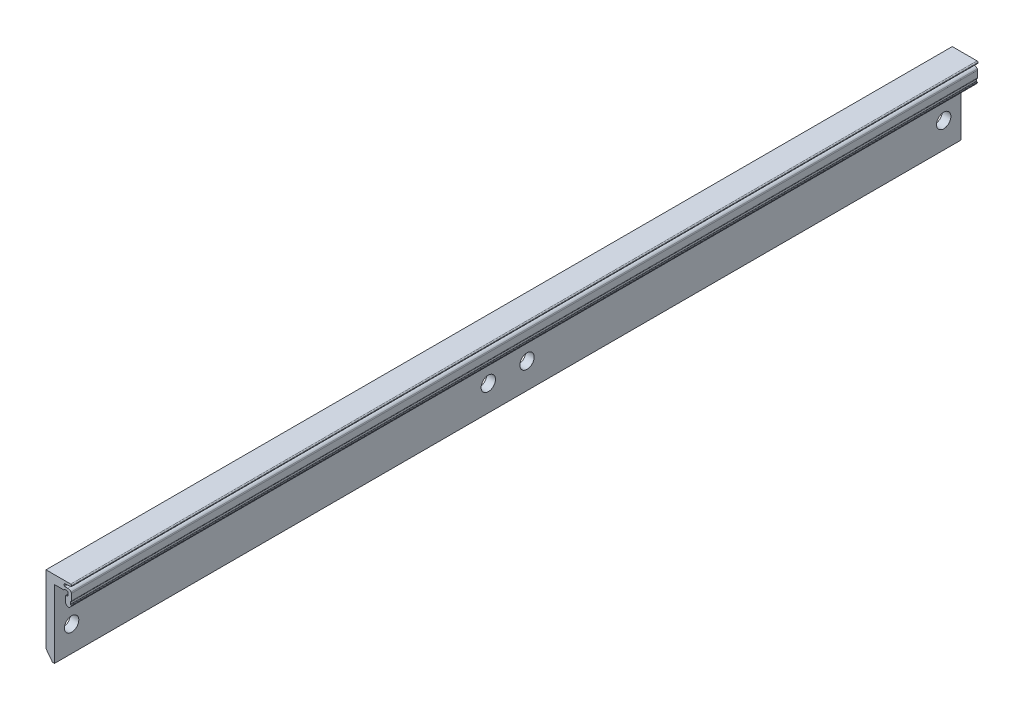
from build123d import *

# Parameters (mm, degrees)
EXTRUDE_1_DEPTH     = 132.675
SKETCH_3_R          = 2.1
CUT_EXTRUDE_2_DEPTH = 3316.268200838


with BuildPart() as part:
    # Sketch 1 → Extrude 1 (new, symmetric)
    with BuildSketch(Plane.XY):
        with BuildLine():
            Line((2350.384035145, -3290.103769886), (2355.384035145, -3290.103769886))
            Line((2355.384035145, -3290.103769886), (2357.624035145, -3290.103769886))
            ThreePointArc((2357.624035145, -3290.103769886), (2357.836167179, -3290.191637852), (2357.924035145, -3290.403769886))
            Line((2357.924035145, -3290.403769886), (2357.924035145, -3290.492459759))
            ThreePointArc((2357.924035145, -3290.492459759), (2357.87266411, -3290.626285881), (2357.744940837, -3290.691364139))
            Line((2357.744940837, -3290.691364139), (2355.903129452, -3290.884946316))
            ThreePointArc((2355.903129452, -3290.884946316), (2355.775406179, -3290.950024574), (2355.724035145, -3291.083850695))
            Line((2355.724035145, -3291.083850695), (2355.724035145, -3291.403769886))
            ThreePointArc((2355.724035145, -3291.403769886), (2355.782613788, -3291.545191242), (2355.924035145, -3291.603769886))
            Line((2355.924035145, -3291.603769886), (2356.769984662, -3291.603769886))
            ThreePointArc((2356.769984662, -3291.603769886), (2357.299096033, -3291.726717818), (2357.719785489, -3292.070367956))
            ThreePointArc((2357.719785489, -3292.070367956), (2357.797255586, -3292.214513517), (2357.824035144, -3292.375952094))
            Line((2357.824035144, -3292.375952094), (2357.824035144, -3294.273769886))
            ThreePointArc((2357.824035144, -3294.273769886), (2357.779946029, -3294.430325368), (2357.660637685, -3294.540864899))
            ThreePointArc((2357.660637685, -3294.540864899), (2357.54132934, -3294.65140443), (2357.497240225, -3294.807959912))
            Line((2357.497240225, -3294.807959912), (2357.497240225, -3295.307959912))
            ThreePointArc((2357.497240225, -3295.307959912), (2357.526529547, -3295.37867059), (2357.597240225, -3295.407959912))
            Line((2357.597240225, -3295.407959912), (2357.724035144, -3295.407959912))
            ThreePointArc((2357.724035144, -3295.407959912), (2357.794745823, -3295.437249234), (2357.824035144, -3295.507959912))
            Line((2357.824035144, -3295.507959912), (2357.824035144, -3295.527361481))
            ThreePointArc((2357.824035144, -3295.527361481), (2357.818000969, -3295.561572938), (2357.800626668, -3295.591655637))
            Line((2357.800626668, -3295.591655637), (2357.383057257, -3296.089092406))
            ThreePointArc((2357.383057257, -3296.089092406), (2356.924035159, -3296.303081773), (2356.465013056, -3296.089092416))
            Line((2356.465013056, -3296.089092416), (2356.094260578, -3295.647427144))
            ThreePointArc((2356.094260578, -3295.647427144), (2356.042137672, -3295.557179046), (2356.024035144, -3295.454544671))
            Line((2356.024035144, -3295.454544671), (2356.024035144, -3294.003769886))
            ThreePointArc((2356.024035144, -3294.003769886), (2356.11190311, -3293.791637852), (2356.324035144, -3293.703769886))
            Line((2356.324035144, -3293.703769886), (2356.524035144, -3293.703769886))
            ThreePointArc((2356.524035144, -3293.703769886), (2356.736167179, -3293.61590192), (2356.824035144, -3293.403769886))
            Line((2356.824035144, -3293.403769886), (2356.824035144, -3292.603769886))
            ThreePointArc((2356.824035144, -3292.603769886), (2356.736167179, -3292.391637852), (2356.524035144, -3292.303769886))
            Line((2356.524035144, -3292.303769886), (2355.987964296, -3292.303769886))
            ThreePointArc((2355.987964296, -3292.303769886), (2355.837964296, -3292.343962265), (2355.728156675, -3292.453769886))
            ThreePointArc((2355.728156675, -3292.453769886), (2355.618349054, -3292.563577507), (2355.468349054, -3292.603769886))
            Line((2355.468349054, -3292.603769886), (2355.384035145, -3292.603769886))
            Line((2355.384035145, -3292.603769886), (2352.884035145, -3292.603769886))
            Line((2352.884035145, -3292.603769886), (2352.884035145, -3312.603769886))
            Line((2352.884035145, -3312.603769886), (2352.284035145, -3312.603769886))
            Line((2352.284035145, -3312.603769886), (2350.384035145, -3310.103769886))
            Line((2350.384035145, -3310.103769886), (2350.384035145, -3292.603769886))
            Line((2350.384035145, -3292.603769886), (2350.384035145, -3290.103769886))
        make_face()
    extrude(amount=EXTRUDE_1_DEPTH, both=True)

    # Sketch 3 → Cut-Extrude 2 (cut, through all)
    with BuildSketch(Plane.ZY.offset(-2350.384035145)):
        with Locations(Location((-127.675, -3305.103769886, 0), (0, 0, 270))):
            Circle(SKETCH_3_R)
        with Locations(Location((127.675, -3305.103769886, 0), (0, 0, 270))):
            Circle(SKETCH_3_R)
        with Locations(Location((-5.675, -3305.103769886, 0), (0, 0, 270))):
            Circle(SKETCH_3_R)
        with Locations(Location((5.675, -3305.103769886, 0), (0, 0, 270))):
            Circle(SKETCH_3_R)
    extrude(amount=-CUT_EXTRUDE_2_DEPTH, mode=Mode.SUBTRACT)


solid = part.part
